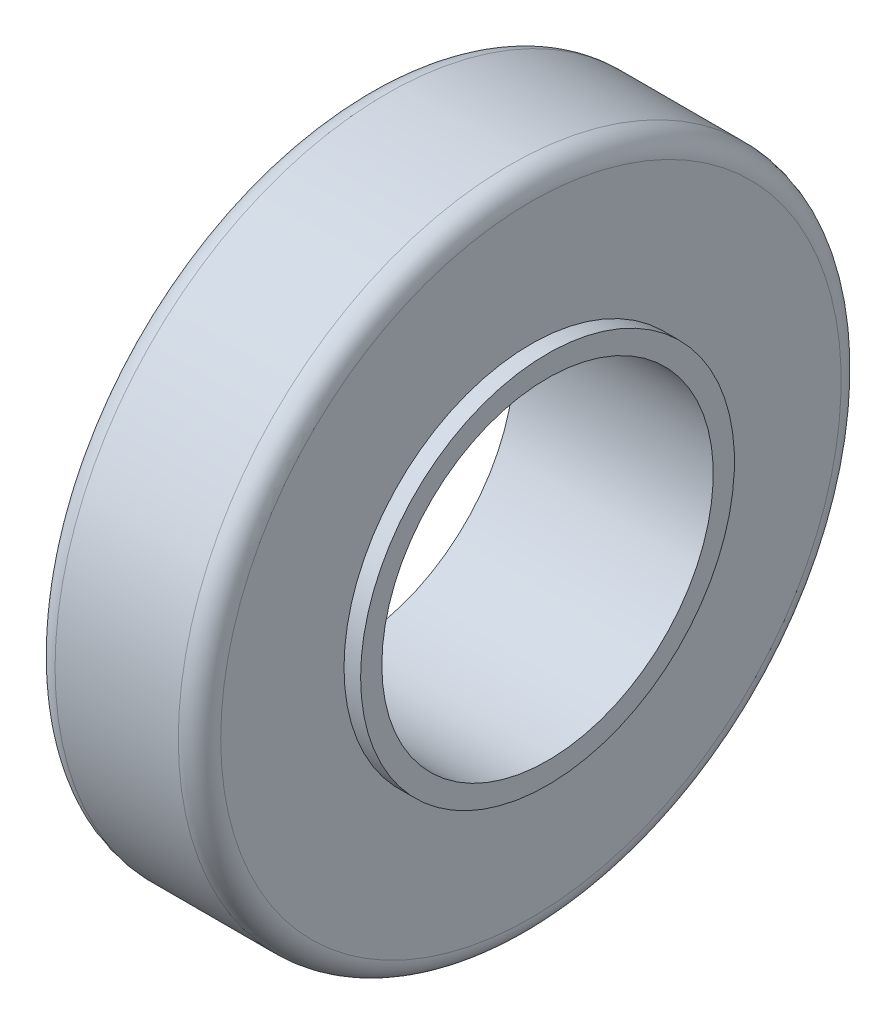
from build123d import *

# Parameters (mm, degrees)
FILLET1_R = 0.508


with BuildPart() as part:
    # Sketch1 → Revolve1 (revolve)
    with BuildSketch(Plane.XY, mode=Mode.PRIVATE) as revolve1_sk:
        Polygon((-2.38125, 3.96875), (2.38125, 3.96875), (2.38125, 4.47675), (1.98374, 4.47675), (1.98374, 7.9375), (-1.98374, 7.9375), (-1.98374, 4.47675), (-2.38125, 4.47675), align=None)
    revolve(revolve1_sk.sketch.rotate(Axis((0, 0, 0), (1, 0, 0)), 90), axis=Axis((0, 0, 0), (1, 0, 0)))

    # Fillet1
    fillet1_edges = [part.edges().sort_by_distance(p)[0] for p in [
        (-1.98374, 0, -7.9375),
        (1.98374, 0, -7.9375),
    ]]
    fillet(fillet1_edges, radius=FILLET1_R)


solid = part.part
